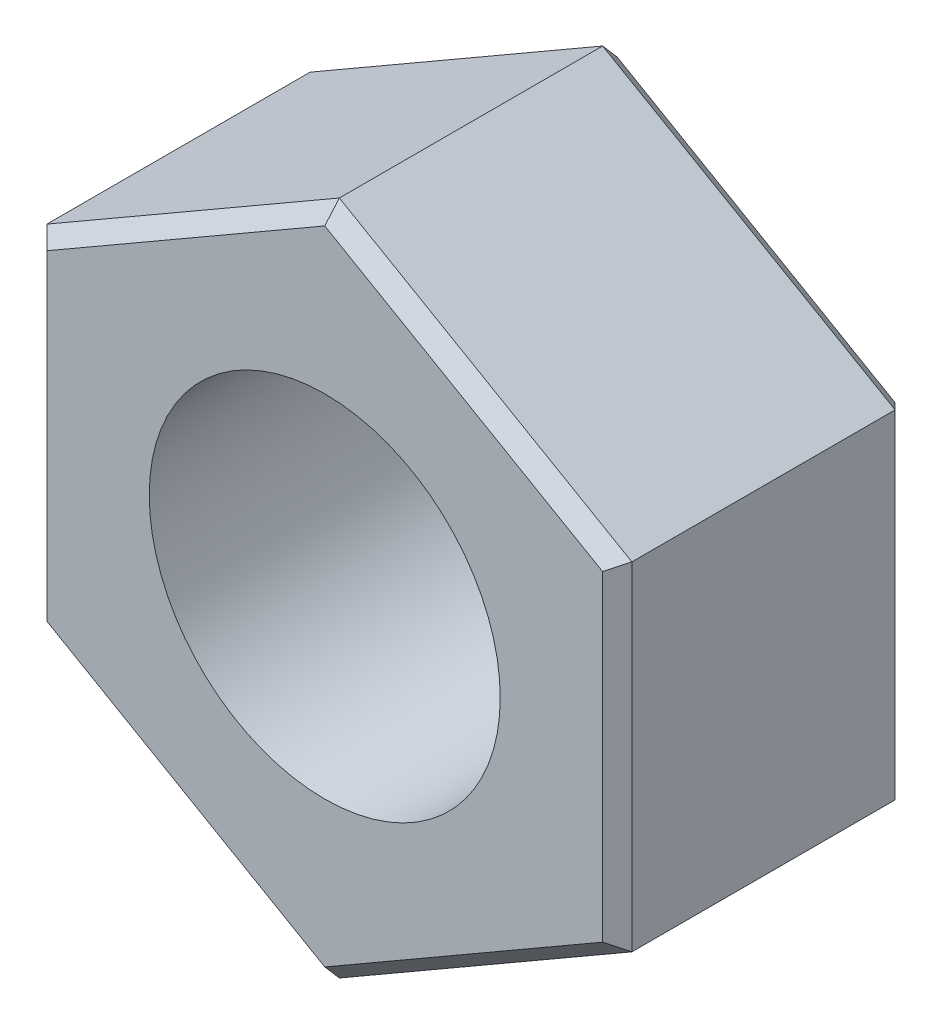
from build123d import *

# Parameters (mm, degrees)
BOSS_EXTRU_1_DEPTH      = 5
CHANFREIN1_SIZE         = 0.25
ESQUISSE2_R             = 3
ENL_V_MAT_EXTRU_1_DEPTH = 10.128709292


with BuildPart() as part:
    # Esquisse1 → Boss.-Extru.1 (new body)
    with BuildSketch(Plane.XY):
        Polygon((0, 5.773502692), (-5, 2.886751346), (-5, -2.886751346), (0, -5.773502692), (5, -2.886751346), (5, 2.886751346), align=None)
    extrude(amount=BOSS_EXTRU_1_DEPTH)

    # Chanfrein1
    chanfrein1_edges = [part.edges().sort_by_distance(p)[0] for p in [
        (-5, 0, 5),
        (-2.5, -4.330127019, 5),
        (2.5, -4.330127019, 5),
        (5, 0, 5),
        (2.5, 4.330127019, 5),
        (5, 0, 0),
        (2.5, -4.330127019, 0),
        (-2.5, -4.330127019, 0),
        (-5, 0, 0),
        (-2.5, 4.330127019, 0),
        (2.5, 4.330127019, 0),
        (-2.5, 4.330127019, 5),
    ]]
    chamfer(chanfrein1_edges, length=CHANFREIN1_SIZE)

    # Esquisse2 → Enl_v. mat.-Extru.1 (cut, through all)
    with BuildSketch(Plane.XY.offset(5)):
        Circle(ESQUISSE2_R)
    extrude(amount=-ENL_V_MAT_EXTRU_1_DEPTH, mode=Mode.SUBTRACT)


solid = part.part
